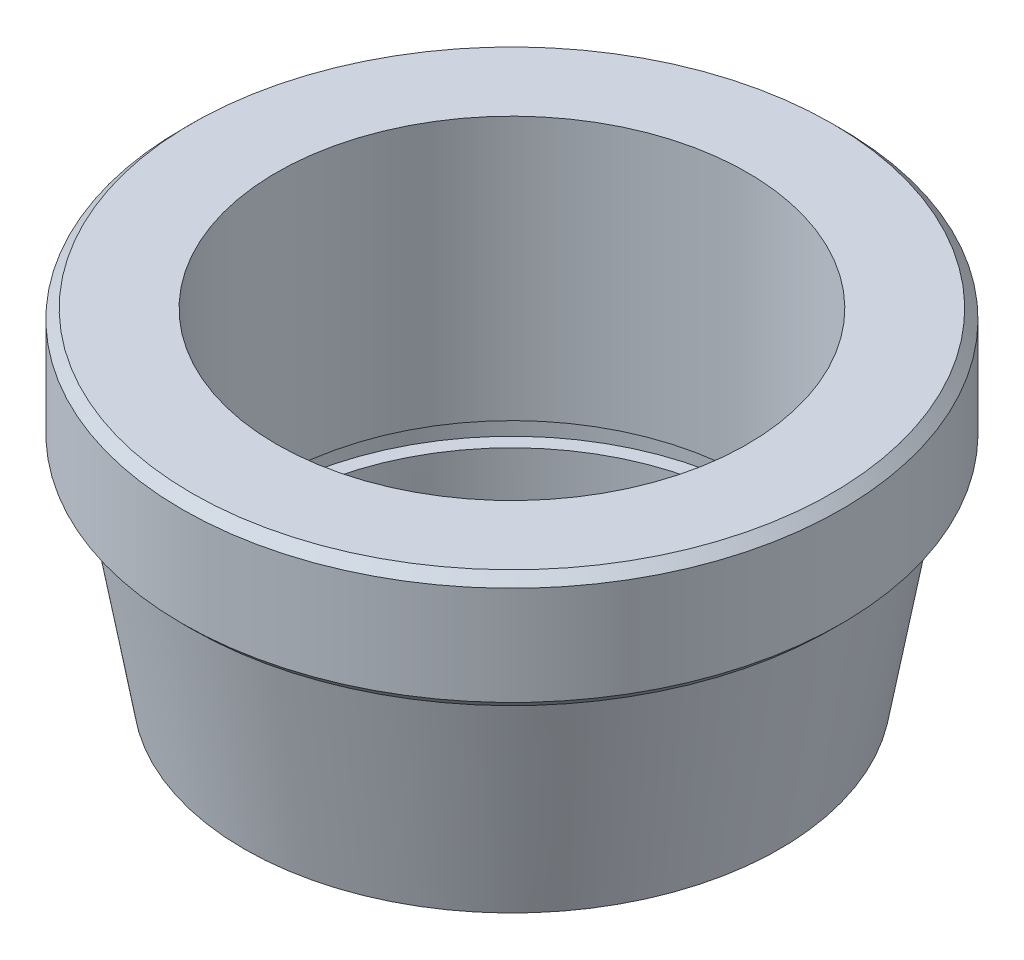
ISO-10303-21;
HEADER;
FILE_DESCRIPTION(('STEP AP214'),'2;1');
FILE_NAME('part.step','',(''),(''),'','','');
FILE_SCHEMA(('AUTOMOTIVE_DESIGN { 1 0 10303 214 1 1 1 1 }'));
ENDSEC;
DATA;
#1=APPLICATION_CONTEXT('core data for automotive mechanical design processes');
#2=APPLICATION_PROTOCOL_DEFINITION('international standard','automotive_design',2000,#1);
#3=PRODUCT_CONTEXT('',#1,'mechanical');
#4=PRODUCT('Part','Part','',(#3));
#5=PRODUCT_RELATED_PRODUCT_CATEGORY('part','',(#4));
#6=PRODUCT_DEFINITION_FORMATION('','',#4);
#7=PRODUCT_DEFINITION_CONTEXT('part definition',#1,'design');
#8=PRODUCT_DEFINITION('design','',#6,#7);
#9=PRODUCT_DEFINITION_SHAPE('','',#8);
#10=(LENGTH_UNIT() NAMED_UNIT(*) SI_UNIT(.MILLI.,.METRE.));
#11=(NAMED_UNIT(*) PLANE_ANGLE_UNIT() SI_UNIT($,.RADIAN.));
#12=(NAMED_UNIT(*) SI_UNIT($,.STERADIAN.) SOLID_ANGLE_UNIT());
#13=UNCERTAINTY_MEASURE_WITH_UNIT(LENGTH_MEASURE(1.E-05),#10,'distance_accuracy_value','');
#14=(GEOMETRIC_REPRESENTATION_CONTEXT(3) GLOBAL_UNCERTAINTY_ASSIGNED_CONTEXT((#13)) GLOBAL_UNIT_ASSIGNED_CONTEXT((#10,
#11,#12)) REPRESENTATION_CONTEXT('',''));
#15=CARTESIAN_POINT('',(0.,0.,0.));
#16=DIRECTION('',(0.,0.,1.));
#17=DIRECTION('',(1.,0.,0.));
#18=AXIS2_PLACEMENT_3D('',#15,#16,#17);
#19=CARTESIAN_POINT('',(0.,0.,0.));
#20=DIRECTION('',(0.,1.,0.));
#21=DIRECTION('',(0.,0.,1.));
#22=AXIS2_PLACEMENT_3D('',#19,#20,#21);
#23=CYLINDRICAL_SURFACE('',#22,5.);
#24=CARTESIAN_POINT('',(0.,-3.1,0.));
#25=DIRECTION('',(0.,1.,0.));
#26=DIRECTION('',(0.,0.,1.));
#27=AXIS2_PLACEMENT_3D('',#24,#25,#26);
#28=CIRCLE('',#27,5.);
#29=CARTESIAN_POINT('',(0.,-3.1,5.));
#30=VERTEX_POINT('',#29);
#31=EDGE_CURVE('E66',#30,#30,#28,.T.);
#32=ORIENTED_EDGE('',*,*,#31,.F.);
#33=EDGE_LOOP('',(#32));
#34=FACE_BOUND('',#33,.T.);
#35=CARTESIAN_POINT('',(0.,2.5,0.));
#36=DIRECTION('',(0.,1.,0.));
#37=DIRECTION('',(0.,0.,1.));
#38=AXIS2_PLACEMENT_3D('',#35,#36,#37);
#39=CIRCLE('',#38,5.);
#40=CARTESIAN_POINT('',(0.,2.5,5.));
#41=VERTEX_POINT('',#40);
#42=EDGE_CURVE('E57',#41,#41,#39,.T.);
#43=ORIENTED_EDGE('',*,*,#42,.T.);
#44=EDGE_LOOP('',(#43));
#45=FACE_BOUND('',#44,.T.);
#46=ADVANCED_FACE('F31',(#34,#45),#23,.F.);
#47=CARTESIAN_POINT('',(0.,0.,0.));
#48=DIRECTION('',(0.,1.,0.));
#49=DIRECTION('',(0.,0.,1.));
#50=AXIS2_PLACEMENT_3D('',#47,#48,#49);
#51=CONICAL_SURFACE('',#50,6.5,0.174532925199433);
#52=CARTESIAN_POINT('',(0.,-4.6,0.));
#53=DIRECTION('',(0.,1.,0.));
#54=DIRECTION('',(0.,0.,1.));
#55=AXIS2_PLACEMENT_3D('',#52,#53,#54);
#56=CIRCLE('',#55,5.68889588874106);
#57=CARTESIAN_POINT('',(0.,-4.6,5.68889588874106));
#58=VERTEX_POINT('',#57);
#59=EDGE_CURVE('E51',#58,#58,#56,.T.);
#60=ORIENTED_EDGE('',*,*,#59,.T.);
#61=EDGE_LOOP('',(#60));
#62=FACE_BOUND('',#61,.T.);
#63=CARTESIAN_POINT('',(0.,0.,0.));
#64=DIRECTION('',(0.,1.,0.));
#65=DIRECTION('',(0.,0.,1.));
#66=AXIS2_PLACEMENT_3D('',#63,#64,#65);
#67=CIRCLE('',#66,6.5);
#68=CARTESIAN_POINT('',(0.,0.,6.5));
#69=VERTEX_POINT('',#68);
#70=EDGE_CURVE('E54',#69,#69,#67,.T.);
#71=ORIENTED_EDGE('',*,*,#70,.F.);
#72=EDGE_LOOP('',(#71));
#73=FACE_BOUND('',#72,.T.);
#74=ADVANCED_FACE('F93',(#62,#73),#51,.T.);
#75=CARTESIAN_POINT('',(0.,-4.6,0.));
#76=DIRECTION('',(0.,1.,0.));
#77=DIRECTION('',(0.,0.,1.));
#78=AXIS2_PLACEMENT_3D('',#75,#76,#77);
#79=PLANE('',#78);
#80=CARTESIAN_POINT('',(0.,-4.6,0.));
#81=DIRECTION('',(0.,-1.,0.));
#82=DIRECTION('',(0.,0.,-1.));
#83=AXIS2_PLACEMENT_3D('',#80,#81,#82);
#84=CIRCLE('',#83,5.);
#85=CARTESIAN_POINT('',(0.,-4.6,-5.));
#86=VERTEX_POINT('',#85);
#87=EDGE_CURVE('E60',#86,#86,#84,.T.);
#88=ORIENTED_EDGE('',*,*,#87,.F.);
#89=EDGE_LOOP('',(#88));
#90=FACE_BOUND('',#89,.T.);
#91=ORIENTED_EDGE('',*,*,#59,.F.);
#92=EDGE_LOOP('',(#91));
#93=FACE_BOUND('',#92,.T.);
#94=ADVANCED_FACE('F108',(#90,#93),#79,.F.);
#95=CARTESIAN_POINT('',(0.,2.5,0.));
#96=DIRECTION('',(0.,-1.,0.));
#97=DIRECTION('',(0.,0.,-1.));
#98=AXIS2_PLACEMENT_3D('',#95,#96,#97);
#99=CYLINDRICAL_SURFACE('',#98,7.);
#100=CARTESIAN_POINT('',(0.,0.2,0.));
#101=DIRECTION('',(0.,1.,0.));
#102=DIRECTION('',(0.,0.,1.));
#103=AXIS2_PLACEMENT_3D('',#100,#101,#102);
#104=CIRCLE('',#103,7.);
#105=CARTESIAN_POINT('',(0.,0.2,7.));
#106=VERTEX_POINT('',#105);
#107=EDGE_CURVE('E42',#106,#106,#104,.T.);
#108=ORIENTED_EDGE('',*,*,#107,.T.);
#109=EDGE_LOOP('',(#108));
#110=FACE_BOUND('',#109,.T.);
#111=CARTESIAN_POINT('',(0.,2.29999999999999,0.));
#112=DIRECTION('',(0.,1.,0.));
#113=DIRECTION('',(0.,0.,1.));
#114=AXIS2_PLACEMENT_3D('',#111,#112,#113);
#115=CIRCLE('',#114,7.);
#116=CARTESIAN_POINT('',(0.,2.29999999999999,7.));
#117=VERTEX_POINT('',#116);
#118=EDGE_CURVE('E46',#117,#117,#115,.F.);
#119=ORIENTED_EDGE('',*,*,#118,.T.);
#120=EDGE_LOOP('',(#119));
#121=FACE_BOUND('',#120,.T.);
#122=ADVANCED_FACE('F100',(#110,#121),#99,.T.);
#123=CARTESIAN_POINT('',(0.,2.5,0.));
#124=DIRECTION('',(0.,1.,0.));
#125=DIRECTION('',(0.,0.,1.));
#126=AXIS2_PLACEMENT_3D('',#123,#124,#125);
#127=PLANE('',#126);
#128=ORIENTED_EDGE('',*,*,#42,.F.);
#129=EDGE_LOOP('',(#128));
#130=FACE_BOUND('',#129,.T.);
#131=CARTESIAN_POINT('',(0.,2.5,0.));
#132=DIRECTION('',(0.,1.,0.));
#133=DIRECTION('',(0.,0.,1.));
#134=AXIS2_PLACEMENT_3D('',#131,#132,#133);
#135=CIRCLE('',#134,6.8);
#136=CARTESIAN_POINT('',(0.,2.5,6.8));
#137=VERTEX_POINT('',#136);
#138=EDGE_CURVE('E10',#137,#137,#135,.T.);
#139=ORIENTED_EDGE('',*,*,#138,.T.);
#140=EDGE_LOOP('',(#139));
#141=FACE_BOUND('',#140,.T.);
#142=ADVANCED_FACE('F97',(#130,#141),#127,.T.);
#143=CARTESIAN_POINT('',(0.,0.,0.));
#144=DIRECTION('',(0.,1.,0.));
#145=DIRECTION('',(0.,0.,1.));
#146=AXIS2_PLACEMENT_3D('',#143,#144,#145);
#147=PLANE('',#146);
#148=CARTESIAN_POINT('',(0.,0.,0.));
#149=DIRECTION('',(0.,1.,0.));
#150=DIRECTION('',(0.,0.,1.));
#151=AXIS2_PLACEMENT_3D('',#148,#149,#150);
#152=CIRCLE('',#151,6.8);
#153=CARTESIAN_POINT('',(0.,0.,6.8));
#154=VERTEX_POINT('',#153);
#155=EDGE_CURVE('E38',#154,#154,#152,.F.);
#156=ORIENTED_EDGE('',*,*,#155,.T.);
#157=EDGE_LOOP('',(#156));
#158=FACE_BOUND('',#157,.T.);
#159=ORIENTED_EDGE('',*,*,#70,.T.);
#160=EDGE_LOOP('',(#159));
#161=FACE_BOUND('',#160,.T.);
#162=ADVANCED_FACE('F99',(#158,#161),#147,.F.);
#163=CARTESIAN_POINT('',(0.,0.2,0.));
#164=DIRECTION('',(0.,1.,0.));
#165=DIRECTION('',(0.,0.,1.));
#166=AXIS2_PLACEMENT_3D('',#163,#164,#165);
#167=CONICAL_SURFACE('',#166,7.,0.785398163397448);
#168=CARTESIAN_POINT('',(0.,0.,6.8));
#169=CARTESIAN_POINT('',(0.,0.0020833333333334,6.80208333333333));
#170=CARTESIAN_POINT('',(0.,0.00416666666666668,6.80416666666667));
#171=CARTESIAN_POINT('',(0.,0.00833333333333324,6.80833333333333));
#172=CARTESIAN_POINT('',(0.,0.0104166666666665,6.81041666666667));
#173=CARTESIAN_POINT('',(0.,0.0145833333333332,6.81458333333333));
#174=CARTESIAN_POINT('',(0.,0.0166666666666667,6.81666666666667));
#175=CARTESIAN_POINT('',(0.,0.0208333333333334,6.82083333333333));
#176=CARTESIAN_POINT('',(0.,0.0229166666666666,6.82291666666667));
#177=CARTESIAN_POINT('',(0.,0.0270833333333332,6.82708333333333));
#178=CARTESIAN_POINT('',(0.,0.0291666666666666,6.82916666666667));
#179=CARTESIAN_POINT('',(0.,0.0333333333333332,6.83333333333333));
#180=CARTESIAN_POINT('',(0.,0.0354166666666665,6.83541666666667));
#181=CARTESIAN_POINT('',(0.,0.0395833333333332,6.83958333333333));
#182=CARTESIAN_POINT('',(0.,0.0416666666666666,6.84166666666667));
#183=CARTESIAN_POINT('',(0.,0.0458333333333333,6.84583333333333));
#184=CARTESIAN_POINT('',(0.,0.0479166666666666,6.84791666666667));
#185=CARTESIAN_POINT('',(0.,0.0520833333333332,6.85208333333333));
#186=CARTESIAN_POINT('',(0.,0.0541666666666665,6.85416666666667));
#187=CARTESIAN_POINT('',(0.,0.0583333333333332,6.85833333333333));
#188=CARTESIAN_POINT('',(0.,0.0604166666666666,6.86041666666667));
#189=CARTESIAN_POINT('',(0.,0.0645833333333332,6.86458333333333));
#190=CARTESIAN_POINT('',(0.,0.0666666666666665,6.86666666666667));
#191=CARTESIAN_POINT('',(0.,0.0708333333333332,6.87083333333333));
#192=CARTESIAN_POINT('',(0.,0.0729166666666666,6.87291666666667));
#193=CARTESIAN_POINT('',(0.,0.0770833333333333,6.87708333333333));
#194=CARTESIAN_POINT('',(0.,0.0791666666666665,6.87916666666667));
#195=CARTESIAN_POINT('',(0.,0.0833333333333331,6.88333333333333));
#196=CARTESIAN_POINT('',(0.,0.0854166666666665,6.88541666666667));
#197=CARTESIAN_POINT('',(0.,0.0895833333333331,6.88958333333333));
#198=CARTESIAN_POINT('',(0.,0.0916666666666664,6.89166666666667));
#199=CARTESIAN_POINT('',(0.,0.0958333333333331,6.89583333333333));
#200=CARTESIAN_POINT('',(0.,0.0979166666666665,6.89791666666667));
#201=CARTESIAN_POINT('',(0.,0.102083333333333,6.90208333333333));
#202=CARTESIAN_POINT('',(0.,0.104166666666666,6.90416666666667));
#203=CARTESIAN_POINT('',(0.,0.108333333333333,6.90833333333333));
#204=CARTESIAN_POINT('',(0.,0.110416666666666,6.91041666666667));
#205=CARTESIAN_POINT('',(0.,0.114583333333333,6.91458333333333));
#206=CARTESIAN_POINT('',(0.,0.116666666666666,6.91666666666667));
#207=CARTESIAN_POINT('',(0.,0.120833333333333,6.92083333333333));
#208=CARTESIAN_POINT('',(0.,0.122916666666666,6.92291666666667));
#209=CARTESIAN_POINT('',(0.,0.127083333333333,6.92708333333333));
#210=CARTESIAN_POINT('',(0.,0.129166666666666,6.92916666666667));
#211=CARTESIAN_POINT('',(0.,0.133333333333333,6.93333333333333));
#212=CARTESIAN_POINT('',(0.,0.135416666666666,6.93541666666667));
#213=CARTESIAN_POINT('',(0.,0.139583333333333,6.93958333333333));
#214=CARTESIAN_POINT('',(0.,0.141666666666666,6.94166666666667));
#215=CARTESIAN_POINT('',(0.,0.145833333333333,6.94583333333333));
#216=CARTESIAN_POINT('',(0.,0.147916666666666,6.94791666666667));
#217=CARTESIAN_POINT('',(0.,0.152083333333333,6.95208333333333));
#218=CARTESIAN_POINT('',(0.,0.154166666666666,6.95416666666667));
#219=CARTESIAN_POINT('',(0.,0.158333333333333,6.95833333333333));
#220=CARTESIAN_POINT('',(0.,0.160416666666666,6.96041666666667));
#221=CARTESIAN_POINT('',(0.,0.164583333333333,6.96458333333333));
#222=CARTESIAN_POINT('',(0.,0.166666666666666,6.96666666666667));
#223=CARTESIAN_POINT('',(0.,0.170833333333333,6.97083333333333));
#224=CARTESIAN_POINT('',(0.,0.172916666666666,6.97291666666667));
#225=CARTESIAN_POINT('',(0.,0.177083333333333,6.97708333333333));
#226=CARTESIAN_POINT('',(0.,0.179166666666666,6.97916666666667));
#227=CARTESIAN_POINT('',(0.,0.183333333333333,6.98333333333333));
#228=CARTESIAN_POINT('',(0.,0.185416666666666,6.98541666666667));
#229=CARTESIAN_POINT('',(0.,0.189583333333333,6.98958333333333));
#230=CARTESIAN_POINT('',(0.,0.191666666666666,6.99166666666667));
#231=CARTESIAN_POINT('',(0.,0.195833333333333,6.99583333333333));
#232=CARTESIAN_POINT('',(0.,0.197916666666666,6.99791666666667));
#233=CARTESIAN_POINT('',(0.,0.2,7.));
#234=B_SPLINE_CURVE_WITH_KNOTS('',3,(#168,#169,#170,#171,#172,#173,#174,#175,#176,#177,#178,
#179,#180,#181,#182,#183,#184,#185,#186,#187,#188,#189,#190,#191,#192,#193,#194,#195,#196,#197,
#198,#199,#200,#201,#202,#203,#204,#205,#206,#207,#208,#209,#210,#211,#212,#213,#214,#215,#216,
#217,#218,#219,#220,#221,#222,#223,#224,#225,#226,#227,#228,#229,#230,#231,#232,#233),
.UNSPECIFIED.,.F.,.F.,(4,2,2,2,2,2,2,2,2,2,2,2,2,2,2,2,2,2,2,2,2,2,2,2,2,2,2,2,2,2,2,2,4),(0.,
0.00883883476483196,0.0176776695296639,0.0265165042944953,0.0353553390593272,0.0441941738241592,
0.0530330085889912,0.0618718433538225,0.0707106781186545,0.0795495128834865,0.0883883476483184,
0.0972271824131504,0.106066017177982,0.114904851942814,0.123743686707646,0.132582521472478,
0.141421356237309,0.150260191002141,0.159099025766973,0.167937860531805,0.176776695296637,
0.185615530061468,0.1944543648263,0.203293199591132,0.212132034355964,0.220970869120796,
0.229809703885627,0.238648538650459,0.247487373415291,0.256326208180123,0.265165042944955,
0.274003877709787,0.282842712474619),.UNSPECIFIED.);
#235=EDGE_CURVE('BSEAM106',#154,#106,#234,.T.);
#236=ORIENTED_EDGE('',*,*,#155,.F.);
#237=ORIENTED_EDGE('',*,*,#107,.F.);
#238=ORIENTED_EDGE('',*,*,#235,.T.);
#239=ORIENTED_EDGE('',*,*,#235,.F.);
#240=EDGE_LOOP('',(#236,#238,#237,#239));
#241=FACE_BOUND('',#240,.T.);
#242=ADVANCED_FACE('F106',(#241),#167,.T.);
#243=CARTESIAN_POINT('',(0.,2.5,0.));
#244=DIRECTION('',(0.,-1.,0.));
#245=DIRECTION('',(0.,0.,-1.));
#246=AXIS2_PLACEMENT_3D('',#243,#244,#245);
#247=CONICAL_SURFACE('',#246,6.8,0.785398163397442);
#248=ORIENTED_EDGE('',*,*,#118,.F.);
#249=EDGE_LOOP('',(#248));
#250=FACE_BOUND('',#249,.T.);
#251=ORIENTED_EDGE('',*,*,#138,.F.);
#252=EDGE_LOOP('',(#251));
#253=FACE_BOUND('',#252,.T.);
#254=ADVANCED_FACE('F33',(#250,#253),#247,.T.);
#255=CARTESIAN_POINT('',(0.,-3.6,0.));
#256=DIRECTION('',(0.,1.,0.));
#257=DIRECTION('',(0.,0.,1.));
#258=AXIS2_PLACEMENT_3D('',#255,#256,#257);
#259=CIRCLE('',#258,5.);
#260=CARTESIAN_POINT('',(0.,-3.6,5.));
#261=VERTEX_POINT('',#260);
#262=EDGE_CURVE('E69',#261,#261,#259,.T.);
#263=ORIENTED_EDGE('',*,*,#262,.T.);
#264=EDGE_LOOP('',(#263));
#265=FACE_BOUND('',#264,.T.);
#266=ORIENTED_EDGE('',*,*,#87,.T.);
#267=EDGE_LOOP('',(#266));
#268=FACE_BOUND('',#267,.T.);
#269=ADVANCED_FACE('F82',(#265,#268),#23,.F.);
#270=CARTESIAN_POINT('',(0.,2.5,0.));
#271=DIRECTION('',(0.,1.,0.));
#272=DIRECTION('',(0.,0.,1.));
#273=AXIS2_PLACEMENT_3D('',#270,#271,#272);
#274=CYLINDRICAL_SURFACE('',#273,5.3);
#275=CARTESIAN_POINT('',(0.,-3.6,0.));
#276=DIRECTION('',(0.,1.,0.));
#277=DIRECTION('',(0.,0.,1.));
#278=AXIS2_PLACEMENT_3D('',#275,#276,#277);
#279=CIRCLE('',#278,5.3);
#280=CARTESIAN_POINT('',(0.,-3.6,5.3));
#281=VERTEX_POINT('',#280);
#282=EDGE_CURVE('E72',#281,#281,#279,.T.);
#283=ORIENTED_EDGE('',*,*,#282,.F.);
#284=EDGE_LOOP('',(#283));
#285=FACE_BOUND('',#284,.T.);
#286=CARTESIAN_POINT('',(0.,-3.1,0.));
#287=DIRECTION('',(0.,1.,0.));
#288=DIRECTION('',(0.,0.,1.));
#289=AXIS2_PLACEMENT_3D('',#286,#287,#288);
#290=CIRCLE('',#289,5.3);
#291=CARTESIAN_POINT('',(0.,-3.1,5.3));
#292=VERTEX_POINT('',#291);
#293=EDGE_CURVE('E63',#292,#292,#290,.T.);
#294=ORIENTED_EDGE('',*,*,#293,.T.);
#295=EDGE_LOOP('',(#294));
#296=FACE_BOUND('',#295,.T.);
#297=ADVANCED_FACE('F78',(#285,#296),#274,.F.);
#298=CARTESIAN_POINT('',(-5.3,-3.1,0.));
#299=DIRECTION('',(0.,1.,0.));
#300=DIRECTION('',(0.,0.,1.));
#301=AXIS2_PLACEMENT_3D('',#298,#299,#300);
#302=PLANE('',#301);
#303=ORIENTED_EDGE('',*,*,#293,.F.);
#304=EDGE_LOOP('',(#303));
#305=FACE_BOUND('',#304,.T.);
#306=ORIENTED_EDGE('',*,*,#31,.T.);
#307=EDGE_LOOP('',(#306));
#308=FACE_BOUND('',#307,.T.);
#309=ADVANCED_FACE('F81',(#305,#308),#302,.F.);
#310=CARTESIAN_POINT('',(-5.3,-3.6,0.));
#311=DIRECTION('',(0.,-1.,0.));
#312=DIRECTION('',(0.,0.,-1.));
#313=AXIS2_PLACEMENT_3D('',#310,#311,#312);
#314=PLANE('',#313);
#315=ORIENTED_EDGE('',*,*,#262,.F.);
#316=EDGE_LOOP('',(#315));
#317=FACE_BOUND('',#316,.T.);
#318=ORIENTED_EDGE('',*,*,#282,.T.);
#319=EDGE_LOOP('',(#318));
#320=FACE_BOUND('',#319,.T.);
#321=ADVANCED_FACE('F76',(#317,#320),#314,.F.);
#322=CLOSED_SHELL('',(#46,#74,#94,#122,#142,#162,#242,#254,#269,#297,#309,#321));
#323=MANIFOLD_SOLID_BREP('B2',#322);
#324=ADVANCED_BREP_SHAPE_REPRESENTATION('',(#18,#323),#14);
#325=SHAPE_DEFINITION_REPRESENTATION(#9,#324);
ENDSEC;
END-ISO-10303-21;
